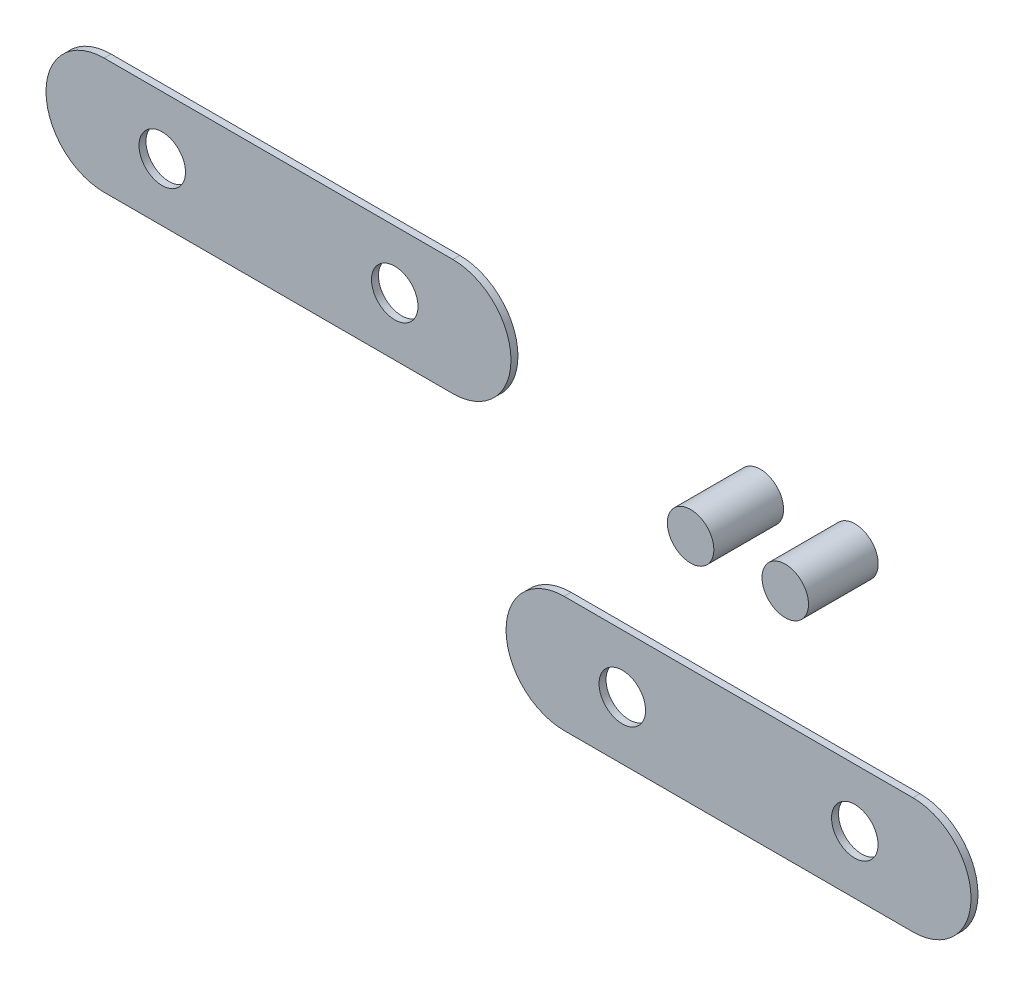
from build123d import *

# Parameters (mm, degrees)
ESBO_O1_R                  = 1
RESSALTO_EXTRUS_O5_DEPTH   = 3
RESSALTO_EXTRUS_O5_2_DEPTH = 3
ESBO_O1_10_R               = 1
RESSALTO_EXTRUS_O6_DEPTH   = 0.3
RESSALTO_EXTRUS_O6_2_DEPTH = 0.3


with BuildPart() as part:
    # Esbo_o1 → Ressalto-extrus_o5 (new body)
    with BuildSketch(Plane.XY):
        with Locations((-6.862282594, 7.656909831)):
            Circle(ESBO_O1_R)
    extrude(amount=RESSALTO_EXTRUS_O5_DEPTH)


with BuildPart() as body_2:
    # Esbo_o1 → Ressalto-extrus_o5 2 (new body)
    with BuildSketch(Plane.XY):
        with Locations((-2.790775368, 7.656909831)):
            Circle(ESBO_O1_R)
    extrude(amount=RESSALTO_EXTRUS_O5_2_DEPTH)


with BuildPart() as body_3:
    # Esbo_o1_10 → Ressalto-extrus_o6 (new body)
    with BuildSketch(Plane.XY):
        with BuildLine():
            ThreePointArc((-15, 0), (-17.5, -2.5), (-15, -5))
            Line((-15, -5), (0, -5))
            ThreePointArc((0, -5), (2.5, -2.5), (0, 0))
            Line((0, 0), (-15, 0))
        make_face()
        with Locations((-2.5, -2.5)):
            Circle(ESBO_O1_10_R, mode=Mode.SUBTRACT)
        with Locations((-12.5, -2.5)):
            Circle(ESBO_O1_10_R, mode=Mode.SUBTRACT)
    extrude(amount=RESSALTO_EXTRUS_O6_DEPTH)


with BuildPart() as body_4:
    # Esbo_o1_10 → Ressalto-extrus_o6 2 (new body)
    with BuildSketch(Plane.XY):
        with BuildLine():
            ThreePointArc((-34.788448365, 10.156909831), (-37.288448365, 7.656909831), (-34.788448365, 5.156909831))
            Line((-34.788448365, 5.156909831), (-19.788448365, 5.156909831))
            ThreePointArc((-19.788448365, 5.156909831), (-17.288448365, 7.656909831), (-19.788448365, 10.156909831))
            Line((-19.788448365, 10.156909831), (-34.788448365, 10.156909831))
        make_face()
        with Locations((-22.288448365, 7.656909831)):
            Circle(ESBO_O1_10_R, mode=Mode.SUBTRACT)
        with Locations((-32.288448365, 7.656909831)):
            Circle(ESBO_O1_10_R, mode=Mode.SUBTRACT)
    extrude(amount=RESSALTO_EXTRUS_O6_2_DEPTH)


solid = Compound([part.part, body_2.part, body_3.part, body_4.part])
